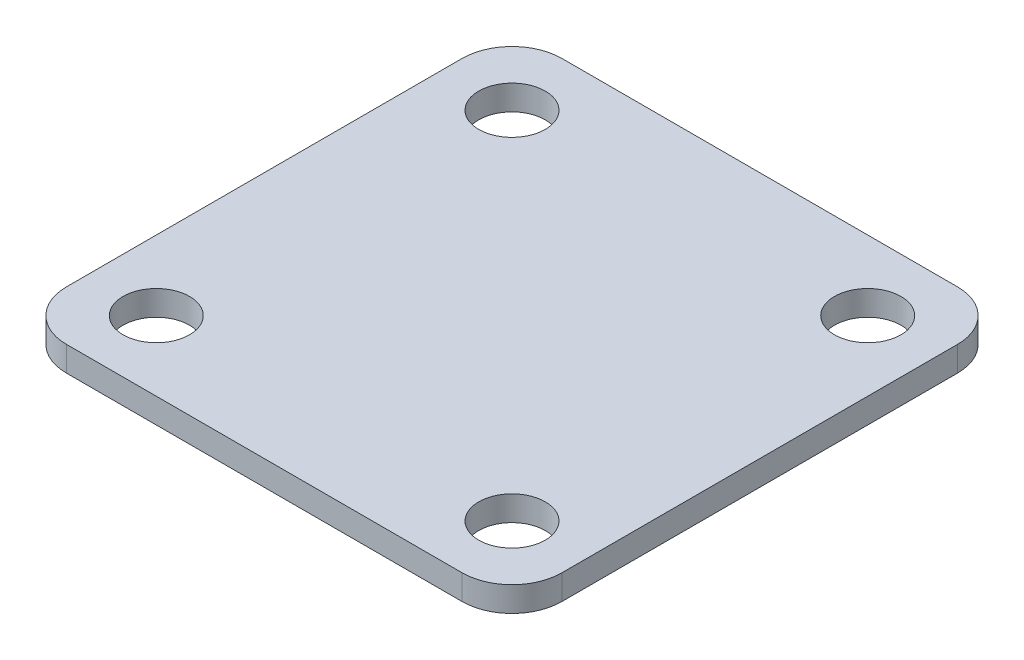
from build123d import *

# Parameters (mm, degrees)
SKETCH1_R           = 3.4925
BOSS_EXTRUDE1_DEPTH = 1.778
SKETCH2_R           = 5.969
BOSS_EXTRUDE2_DEPTH = 4.699
SKETCH3_R           = 2.54
BOSS_EXTRUDE3_DEPTH = 1.905
CHAMFER1_SIZE       = 1.4224
CHAMFER1_SIZE2      = 3.705478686
FILLET1_R           = 1.27


with BuildPart() as part:
    # Sketch1 → Boss-Extrude1 (new body)
    with BuildSketch(Plane(origin=(0, 0, 0), x_dir=(1, 0, 0), z_dir=(0, 1, 0))):
        with Locations(Location((0, 0, 0), (0, 0, 270))):
            Circle(SKETCH1_R)
    extrude(amount=BOSS_EXTRUDE1_DEPTH)

    # Sketch2 → Boss-Extrude2 (add)
    with BuildSketch(Plane(origin=(0, 1.778, 0), x_dir=(1, 0, 0), z_dir=(0, 1, 0))):
        with Locations(Location((0, 0, 0), (0, 0, 270))):
            Circle(SKETCH2_R)
    extrude(amount=BOSS_EXTRUDE2_DEPTH)

    # Sketch3 → Boss-Extrude3 (add)
    with BuildSketch(Plane(origin=(0, 6.477, 0), x_dir=(1, 0, 0), z_dir=(0, 1, 0))):
        with BuildLine():
            Line((-15.113, 18.923), (15.113, 18.923))
            ThreePointArc((15.113, 18.923), (17.807076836, 17.807076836), (18.923, 15.113))
            Line((18.923, 15.113), (18.923, -15.113))
            ThreePointArc((18.923, -15.113), (17.807076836, -17.807076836), (15.113, -18.923))
            Line((15.113, -18.923), (-15.113, -18.923))
            ThreePointArc((-15.113, -18.923), (-17.807076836, -17.807076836), (-18.923, -15.113))
            Line((-18.923, -15.113), (-18.923, 15.113))
            ThreePointArc((-18.923, 15.113), (-17.807076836, 17.807076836), (-15.113, 18.923))
        make_face()
        with Locations(Location((-13.589, 13.589, 0), (0, 0, 90))):
            Circle(SKETCH3_R, mode=Mode.SUBTRACT)
        with Locations(Location((13.589, 13.589, 0), (0, 0, 90))):
            Circle(SKETCH3_R, mode=Mode.SUBTRACT)
        with Locations(Location((13.589, -13.589, 0), (0, 0, 90))):
            Circle(SKETCH3_R, mode=Mode.SUBTRACT)
        with Locations(Location((-13.589, -13.589, 0), (0, 0, 90))):
            Circle(SKETCH3_R, mode=Mode.SUBTRACT)
    extrude(amount=BOSS_EXTRUDE3_DEPTH)

    # Chamfer1
    chamfer1_edges = [part.edges().sort_by_distance(p)[0] for p in [
        (0, 6.477, -5.969),
    ]]
    chamfer1_side = [part.faces().sort_by_distance(p)[0] for p in [
        (0, 4.1275, -5.969),
    ]]
    chamfer(chamfer1_edges, length=CHAMFER1_SIZE, length2=CHAMFER1_SIZE2, reference=chamfer1_side[0])

    # Fillet1
    fillet1_edges = [part.edges().sort_by_distance(p)[0] for p in [
        (0, 1.778, -5.969),
    ]]
    fillet(fillet1_edges, radius=FILLET1_R)


solid = part.part
